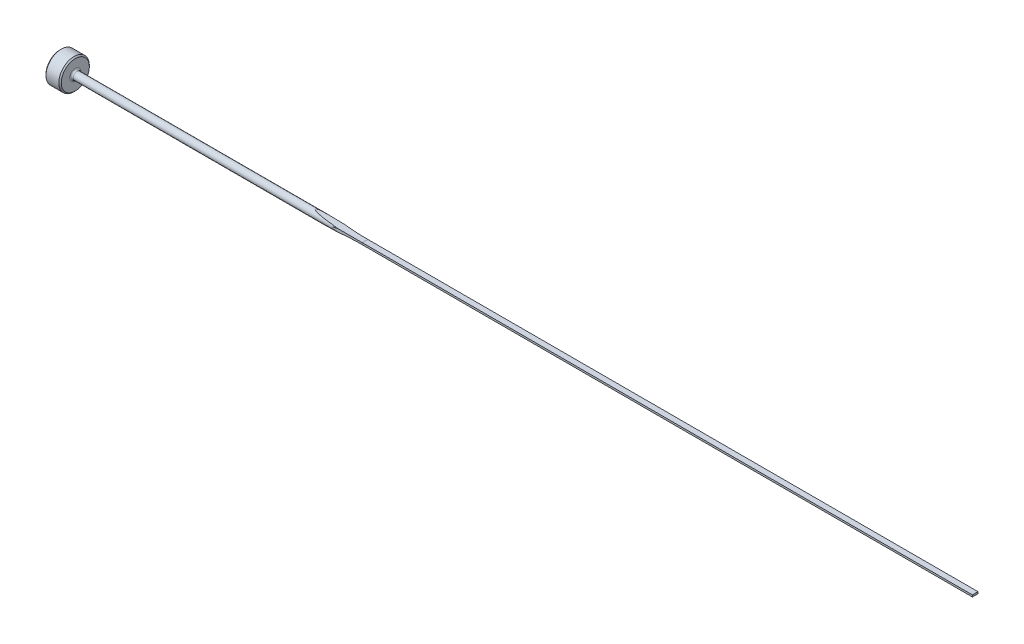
ISO-10303-21;
HEADER;
FILE_DESCRIPTION(('STEP AP214'),'2;1');
FILE_NAME('part.step','',(''),(''),'','','');
FILE_SCHEMA(('AUTOMOTIVE_DESIGN { 1 0 10303 214 1 1 1 1 }'));
ENDSEC;
DATA;
#1=APPLICATION_CONTEXT('core data for automotive mechanical design processes');
#2=APPLICATION_PROTOCOL_DEFINITION('international standard','automotive_design',2000,#1);
#3=PRODUCT_CONTEXT('',#1,'mechanical');
#4=PRODUCT('Part','Part','',(#3));
#5=PRODUCT_RELATED_PRODUCT_CATEGORY('part','',(#4));
#6=PRODUCT_DEFINITION_FORMATION('','',#4);
#7=PRODUCT_DEFINITION_CONTEXT('part definition',#1,'design');
#8=PRODUCT_DEFINITION('design','',#6,#7);
#9=PRODUCT_DEFINITION_SHAPE('','',#8);
#10=(LENGTH_UNIT() NAMED_UNIT(*) SI_UNIT(.MILLI.,.METRE.));
#11=(NAMED_UNIT(*) PLANE_ANGLE_UNIT() SI_UNIT($,.RADIAN.));
#12=(NAMED_UNIT(*) SI_UNIT($,.STERADIAN.) SOLID_ANGLE_UNIT());
#13=UNCERTAINTY_MEASURE_WITH_UNIT(LENGTH_MEASURE(1.E-05),#10,'distance_accuracy_value','');
#14=(GEOMETRIC_REPRESENTATION_CONTEXT(3) GLOBAL_UNCERTAINTY_ASSIGNED_CONTEXT((#13)) GLOBAL_UNIT_ASSIGNED_CONTEXT((#10,
#11,#12)) REPRESENTATION_CONTEXT('',''));
#15=CARTESIAN_POINT('',(0.,0.,0.));
#16=DIRECTION('',(0.,0.,1.));
#17=DIRECTION('',(1.,0.,0.));
#18=AXIS2_PLACEMENT_3D('',#15,#16,#17);
#19=CARTESIAN_POINT('',(0.,0.,0.));
#20=DIRECTION('',(-1.,0.,0.));
#21=DIRECTION('',(0.,0.,1.));
#22=AXIS2_PLACEMENT_3D('',#19,#20,#21);
#23=CYLINDRICAL_SURFACE('',#22,0.79375);
#24=CARTESIAN_POINT('',(3.556,0.,0.));
#25=DIRECTION('',(-1.,0.,0.));
#26=DIRECTION('',(0.,0.,1.));
#27=AXIS2_PLACEMENT_3D('',#24,#25,#26);
#28=CIRCLE('',#27,0.79375);
#29=CARTESIAN_POINT('',(3.556,0.,0.79375));
#30=VERTEX_POINT('',#29);
#31=EDGE_CURVE('E152',#30,#30,#28,.F.);
#32=ORIENTED_EDGE('',*,*,#31,.T.);
#33=EDGE_LOOP('',(#32));
#34=FACE_BOUND('',#33,.T.);
#35=CARTESIAN_POINT('',(63.5,0.537354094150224,0.584199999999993));
#36=CARTESIAN_POINT('',(63.3677986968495,0.537352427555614,0.584199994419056));
#37=CARTESIAN_POINT('',(63.2355977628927,0.537033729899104,0.584494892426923));
#38=CARTESIAN_POINT('',(62.9711986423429,0.535747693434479,0.585674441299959));
#39=CARTESIAN_POINT('',(62.8390004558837,0.534780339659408,0.586559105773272));
#40=CARTESIAN_POINT('',(62.4420069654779,0.53087936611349,0.590101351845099));
#41=CARTESIAN_POINT('',(62.1772280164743,0.526946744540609,0.593647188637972));
#42=CARTESIAN_POINT('',(61.6475584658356,0.516094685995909,0.603107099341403));
#43=CARTESIAN_POINT('',(61.3826679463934,0.509172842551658,0.609023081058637));
#44=CARTESIAN_POINT('',(60.8530338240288,0.491693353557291,0.623220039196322));
#45=CARTESIAN_POINT('',(60.58829024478,0.481135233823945,0.631501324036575));
#46=CARTESIAN_POINT('',(60.0594832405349,0.455276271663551,0.650407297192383));
#47=CARTESIAN_POINT('',(59.7954193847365,0.439982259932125,0.661028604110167));
#48=CARTESIAN_POINT('',(59.39981069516,0.411723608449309,0.678705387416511));
#49=CARTESIAN_POINT('',(59.2680369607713,0.401419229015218,0.684887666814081));
#50=CARTESIAN_POINT('',(59.004722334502,0.378486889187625,0.697828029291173));
#51=CARTESIAN_POINT('',(58.8731814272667,0.36585908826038,0.704586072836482));
#52=CARTESIAN_POINT('',(58.6761769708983,0.344482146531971,0.715145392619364));
#53=CARTESIAN_POINT('',(58.6105699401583,0.33695195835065,0.71873496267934));
#54=CARTESIAN_POINT('',(58.4794798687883,0.320881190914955,0.726052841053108));
#55=CARTESIAN_POINT('',(58.4139968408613,0.312340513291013,0.729781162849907));
#56=CARTESIAN_POINT('',(58.2830735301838,0.293954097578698,0.737380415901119));
#57=CARTESIAN_POINT('',(58.2176336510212,0.284105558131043,0.741251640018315));
#58=CARTESIAN_POINT('',(58.0870608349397,0.262655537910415,0.749120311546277));
#59=CARTESIAN_POINT('',(58.0219278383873,0.25105441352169,0.753117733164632));
#60=CARTESIAN_POINT('',(57.8919403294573,0.22526665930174,0.761238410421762));
#61=CARTESIAN_POINT('',(57.8270873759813,0.211071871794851,0.765362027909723));
#62=CARTESIAN_POINT('',(57.7307839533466,0.1864338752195,0.771589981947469));
#63=CARTESIAN_POINT('',(57.6989102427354,0.177685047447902,0.773668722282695));
#64=CARTESIAN_POINT('',(57.6356848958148,0.158500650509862,0.777825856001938));
#65=CARTESIAN_POINT('',(57.6043331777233,0.14806534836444,0.779904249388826));
#66=CARTESIAN_POINT('',(57.5449685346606,0.12536357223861,0.783870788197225));
#67=CARTESIAN_POINT('',(57.5168860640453,0.113303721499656,0.785761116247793));
#68=CARTESIAN_POINT('',(57.4787827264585,0.0926836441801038,0.788342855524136));
#69=CARTESIAN_POINT('',(57.4676987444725,0.0861257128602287,0.789096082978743));
#70=CARTESIAN_POINT('',(57.4464596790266,0.0716589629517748,0.790543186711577));
#71=CARTESIAN_POINT('',(57.4362989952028,0.0637592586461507,0.791237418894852));
#72=CARTESIAN_POINT('',(57.4241935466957,0.0517558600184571,0.792066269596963));
#73=CARTESIAN_POINT('',(57.4212914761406,0.0486376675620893,0.792265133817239));
#74=CARTESIAN_POINT('',(57.4158307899,0.0421001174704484,0.792639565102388));
#75=CARTESIAN_POINT('',(57.4132726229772,0.0386803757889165,0.792815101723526));
#76=CARTESIAN_POINT('',(57.4086203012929,0.0314630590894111,0.793134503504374));
#77=CARTESIAN_POINT('',(57.4065328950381,0.0276609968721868,0.793277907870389));
#78=CARTESIAN_POINT('',(57.4030925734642,0.0197374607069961,0.793514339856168));
#79=CARTESIAN_POINT('',(57.4017370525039,0.0156171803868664,0.793607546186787));
#80=CARTESIAN_POINT('',(57.4002141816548,0.00832744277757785,0.793712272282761));
#81=CARTESIAN_POINT('',(57.3998236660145,0.00520497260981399,0.793739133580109));
#82=CARTESIAN_POINT('',(57.3995863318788,-0.0010609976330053,0.793755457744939));
#83=CARTESIAN_POINT('',(57.3997393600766,-0.00420449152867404,0.793744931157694));
#84=CARTESIAN_POINT('',(57.4005699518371,-0.0104090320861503,0.793687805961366));
#85=CARTESIAN_POINT('',(57.4012458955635,-0.013470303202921,0.793641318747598));
#86=CARTESIAN_POINT('',(57.4030509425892,-0.0194544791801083,0.793517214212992));
#87=CARTESIAN_POINT('',(57.4041804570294,-0.0223772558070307,0.79343956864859));
#88=CARTESIAN_POINT('',(57.4075834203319,-0.0297362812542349,0.793205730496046));
#89=CARTESIAN_POINT('',(57.410137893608,-0.0340408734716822,0.793030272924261));
#90=CARTESIAN_POINT('',(57.4158647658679,-0.0422141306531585,0.792637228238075));
#91=CARTESIAN_POINT('',(57.4190391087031,-0.0460813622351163,0.792419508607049));
#92=CARTESIAN_POINT('',(57.4306425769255,-0.0587562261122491,0.791624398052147));
#93=CARTESIAN_POINT('',(57.4400482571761,-0.0666461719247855,0.790981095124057));
#94=CARTESIAN_POINT('',(57.4598384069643,-0.0810740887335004,0.78963111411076));
#95=CARTESIAN_POINT('',(57.470228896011,-0.0876028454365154,0.788924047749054));
#96=CARTESIAN_POINT('',(57.5002052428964,-0.104735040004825,0.786889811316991));
#97=CARTESIAN_POINT('',(57.5203710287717,-0.114312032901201,0.785527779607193));
#98=CARTESIAN_POINT('',(57.5614041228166,-0.131848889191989,0.782770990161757));
#99=CARTESIAN_POINT('',(57.5822732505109,-0.13980411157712,0.78137615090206));
#100=CARTESIAN_POINT('',(57.6454933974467,-0.162091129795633,0.777173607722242));
#101=CARTESIAN_POINT('',(57.688404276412,-0.17481938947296,0.774351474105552));
#102=CARTESIAN_POINT('',(57.8170052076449,-0.20942402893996,0.765989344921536));
#103=CARTESIAN_POINT('',(57.9035078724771,-0.228079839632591,0.760489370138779));
#104=CARTESIAN_POINT('',(58.0773949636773,-0.261317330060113,0.749691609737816));
#105=CARTESIAN_POINT('',(58.1647806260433,-0.275892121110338,0.744394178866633));
#106=CARTESIAN_POINT('',(58.3398406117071,-0.302364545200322,0.734042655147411));
#107=CARTESIAN_POINT('',(58.4275143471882,-0.314265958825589,0.728988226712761));
#108=CARTESIAN_POINT('',(58.6030327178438,-0.336200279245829,0.719131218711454));
#109=CARTESIAN_POINT('',(58.6908771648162,-0.346234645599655,0.714328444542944));
#110=CARTESIAN_POINT('',(58.9696341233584,-0.375842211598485,0.699503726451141));
#111=CARTESIAN_POINT('',(59.1608447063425,-0.392834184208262,0.689952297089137));
#112=CARTESIAN_POINT('',(59.5436524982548,-0.422669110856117,0.672072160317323));
#113=CARTESIAN_POINT('',(59.7352497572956,-0.435511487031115,0.663743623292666));
#114=CARTESIAN_POINT('',(60.118807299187,-0.458164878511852,0.648315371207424));
#115=CARTESIAN_POINT('',(60.3107677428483,-0.467973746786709,0.641216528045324));
#116=CARTESIAN_POINT('',(60.6948219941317,-0.485222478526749,0.628261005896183));
#117=CARTESIAN_POINT('',(60.8869157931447,-0.492662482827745,0.622404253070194));
#118=CARTESIAN_POINT('',(61.4633489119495,-0.512094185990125,0.60670099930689));
#119=CARTESIAN_POINT('',(61.847838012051,-0.521197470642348,0.59872158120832));
#120=CARTESIAN_POINT('',(62.6168658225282,-0.53352023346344,0.587755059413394));
#121=CARTESIAN_POINT('',(63.0014044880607,-0.536741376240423,0.584766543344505));
#122=CARTESIAN_POINT('',(63.4239617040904,-0.537327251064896,0.584224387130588));
#123=CARTESIAN_POINT('',(63.4619808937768,-0.537353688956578,0.584199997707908));
#124=CARTESIAN_POINT('',(63.5,-0.537354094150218,0.584199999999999));
#125=B_SPLINE_CURVE_WITH_KNOTS('',3,(#35,#36,#37,#38,#39,#40,#41,#42,#43,#44,#45,#46,#47,#48,
#49,#50,#51,#52,#53,#54,#55,#56,#57,#58,#59,#60,#61,#62,#63,#64,#65,#66,#67,#68,#69,#70,#71,#72,
#73,#74,#75,#76,#77,#78,#79,#80,#81,#82,#83,#84,#85,#86,#87,#88,#89,#90,#91,#92,#93,#94,#95,#96,
#97,#98,#99,#100,#101,#102,#103,#104,#105,#106,#107,#108,#109,#110,#111,#112,#113,#114,#115,
#116,#117,#118,#119,#120,#121,#122,#123,#124),.UNSPECIFIED.,.F.,.F.,(4,2,2,2,2,2,2,2,2,2,2,2,2,
2,2,2,2,2,2,2,2,2,2,2,2,2,2,2,2,2,2,2,2,2,2,2,2,2,2,2,2,2,2,2,4),(0.,0.396602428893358,
0.793214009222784,1.58768292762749,2.38279262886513,3.1780060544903,3.97207782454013,
4.36902531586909,4.76594557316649,4.96434526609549,5.16276428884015,5.36161538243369,
5.56042609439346,5.7598732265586,5.85918782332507,5.95848671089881,6.05003157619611,
6.08869793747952,6.12711144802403,6.13988635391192,6.15267777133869,6.16564230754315,
6.17856037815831,6.18795697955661,6.19735093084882,6.20671589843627,6.21608937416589,
6.23102781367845,6.24601387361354,6.28261070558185,6.3194477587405,6.38636719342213,
6.45347552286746,6.58786698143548,6.85363398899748,7.11984693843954,7.38568101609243,
7.65130639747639,8.22782048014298,8.80441481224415,9.38141631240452,9.95838350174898,
11.1123237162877,12.2659373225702,12.37999486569),.UNSPECIFIED.);
#126=CARTESIAN_POINT('',(58.5437773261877,0.328763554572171,0.722463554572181));
#127=VERTEX_POINT('',#126);
#128=CARTESIAN_POINT('',(58.5437773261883,-0.328763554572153,0.722463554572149));
#129=VERTEX_POINT('',#128);
#130=EDGE_CURVE('E155',#127,#129,#125,.T.);
#131=ORIENTED_EDGE('',*,*,#130,.F.);
#132=CARTESIAN_POINT('',(63.5,0.190499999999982,0.770550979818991));
#133=CARTESIAN_POINT('',(63.2354977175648,0.190500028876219,0.770543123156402));
#134=CARTESIAN_POINT('',(62.9709978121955,0.191680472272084,0.770261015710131));
#135=CARTESIAN_POINT('',(62.4418252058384,0.196403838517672,0.769072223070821));
#136=CARTESIAN_POINT('',(62.1771525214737,0.199948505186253,0.768165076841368));
#137=CARTESIAN_POINT('',(61.3824806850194,0.21414145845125,0.764388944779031));
#138=CARTESIAN_POINT('',(60.8525422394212,0.228348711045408,0.760464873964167));
#139=CARTESIAN_POINT('',(60.0578861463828,0.256766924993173,0.751134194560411));
#140=CARTESIAN_POINT('',(59.7930152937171,0.267425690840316,0.747449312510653));
#141=CARTESIAN_POINT('',(59.2634058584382,0.291110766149,0.738549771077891));
#142=CARTESIAN_POINT('',(58.9986672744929,0.304137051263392,0.733335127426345));
#143=CARTESIAN_POINT('',(58.4695875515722,0.33254218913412,0.720898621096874));
#144=CARTESIAN_POINT('',(58.2052462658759,0.34791904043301,0.713678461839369));
#145=CARTESIAN_POINT('',(57.676798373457,0.381028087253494,0.696567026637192));
#146=CARTESIAN_POINT('',(57.4126917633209,0.398760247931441,0.686675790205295));
#147=CARTESIAN_POINT('',(56.8849021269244,0.436563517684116,0.663283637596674));
#148=CARTESIAN_POINT('',(56.6212189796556,0.456633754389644,0.649784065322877));
#149=CARTESIAN_POINT('',(56.0943507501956,0.499099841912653,0.617784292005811));
#150=CARTESIAN_POINT('',(55.831165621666,0.521495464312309,0.599284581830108));
#151=CARTESIAN_POINT('',(55.4370166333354,0.556801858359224,0.565921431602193));
#152=CARTESIAN_POINT('',(55.3057389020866,0.568856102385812,0.553864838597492));
#153=CARTESIAN_POINT('',(55.0434383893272,0.593528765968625,0.527346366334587));
#154=CARTESIAN_POINT('',(54.9124156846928,0.606147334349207,0.512883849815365));
#155=CARTESIAN_POINT('',(54.6506137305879,0.631946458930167,0.48073579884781));
#156=CARTESIAN_POINT('',(54.5198351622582,0.645127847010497,0.463045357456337));
#157=CARTESIAN_POINT('',(54.2590586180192,0.671994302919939,0.423151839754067));
#158=CARTESIAN_POINT('',(54.1290602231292,0.685679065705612,0.400951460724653));
#159=CARTESIAN_POINT('',(53.9485864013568,0.705076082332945,0.364742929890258));
#160=CARTESIAN_POINT('',(53.8974648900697,0.710615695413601,0.353876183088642));
#161=CARTESIAN_POINT('',(53.7955354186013,0.721749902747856,0.330583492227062));
#162=CARTESIAN_POINT('',(53.7447277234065,0.727344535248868,0.318156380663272));
#163=CARTESIAN_POINT('',(53.643779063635,0.738547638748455,0.291200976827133));
#164=CARTESIAN_POINT('',(53.5936370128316,0.744156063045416,0.276676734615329));
#165=CARTESIAN_POINT('',(53.4943683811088,0.755343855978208,0.244529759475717));
#166=CARTESIAN_POINT('',(53.4452403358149,0.760923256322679,0.226911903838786));
#167=CARTESIAN_POINT('',(53.3731852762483,0.769164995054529,0.196296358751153));
#168=CARTESIAN_POINT('',(53.3493942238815,0.771896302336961,0.185367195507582));
#169=CARTESIAN_POINT('',(53.3028927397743,0.777253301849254,0.161463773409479));
#170=CARTESIAN_POINT('',(53.2801786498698,0.779879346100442,0.148497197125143));
#171=CARTESIAN_POINT('',(53.2500391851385,0.783374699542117,0.128048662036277));
#172=CARTESIAN_POINT('',(53.2416704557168,0.784346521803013,0.121988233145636));
#173=CARTESIAN_POINT('',(53.225433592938,0.786234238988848,0.109166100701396));
#174=CARTESIAN_POINT('',(53.2175668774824,0.78714997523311,0.102402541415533));
#175=CARTESIAN_POINT('',(53.2025456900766,0.788900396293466,0.0879169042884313));
#176=CARTESIAN_POINT('',(53.1954016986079,0.789733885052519,0.0801836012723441));
#177=CARTESIAN_POINT('',(53.1825061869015,0.791239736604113,0.0636171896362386));
#178=CARTESIAN_POINT('',(53.1767475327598,0.791912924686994,0.0547900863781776));
#179=CARTESIAN_POINT('',(53.1696621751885,0.792741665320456,0.0403159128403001));
#180=CARTESIAN_POINT('',(53.1675163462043,0.792992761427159,0.0350797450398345));
#181=CARTESIAN_POINT('',(53.1640779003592,0.793395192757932,0.0243299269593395));
#182=CARTESIAN_POINT('',(53.1627841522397,0.7935466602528,0.0188166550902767));
#183=CARTESIAN_POINT('',(53.1611884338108,0.793733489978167,0.00760256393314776));
#184=CARTESIAN_POINT('',(53.1608934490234,0.793768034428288,0.00190070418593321));
#185=CARTESIAN_POINT('',(53.1613552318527,0.793713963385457,-0.0094609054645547));
#186=CARTESIAN_POINT('',(53.1621124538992,0.793625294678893,-0.0151206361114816));
#187=CARTESIAN_POINT('',(53.1644878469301,0.793347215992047,-0.025801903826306));
#188=CARTESIAN_POINT('',(53.1660373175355,0.793165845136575,-0.0308394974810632));
#189=CARTESIAN_POINT('',(53.1698145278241,0.792723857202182,-0.0406454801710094));
#190=CARTESIAN_POINT('',(53.1720424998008,0.792463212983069,-0.0454137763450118));
#191=CARTESIAN_POINT('',(53.1790063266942,0.791648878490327,-0.0583107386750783));
#192=CARTESIAN_POINT('',(53.1843320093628,0.791026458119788,-0.0661144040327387));
#193=CARTESIAN_POINT('',(53.1960671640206,0.789656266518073,-0.0808494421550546));
#194=CARTESIAN_POINT('',(53.2024807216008,0.788908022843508,-0.087777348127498));
#195=CARTESIAN_POINT('',(53.2270824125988,0.786040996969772,-0.111767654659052));
#196=CARTESIAN_POINT('',(53.2472565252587,0.783695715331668,-0.126716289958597));
#197=CARTESIAN_POINT('',(53.2893601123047,0.778817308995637,-0.153835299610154));
#198=CARTESIAN_POINT('',(53.3113004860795,0.776283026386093,-0.165986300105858));
#199=CARTESIAN_POINT('',(53.3770598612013,0.768713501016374,-0.199075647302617));
#200=CARTESIAN_POINT('',(53.4220934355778,0.763562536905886,-0.217563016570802));
#201=CARTESIAN_POINT('',(53.5134440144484,0.753187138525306,-0.251080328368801));
#202=CARTESIAN_POINT('',(53.5597643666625,0.747962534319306,-0.266100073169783));
#203=CARTESIAN_POINT('',(53.6531707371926,0.737502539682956,-0.293855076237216));
#204=CARTESIAN_POINT('',(53.7002578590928,0.732267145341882,-0.306586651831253));
#205=CARTESIAN_POINT('',(53.7947678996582,0.721836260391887,-0.330390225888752));
#206=CARTESIAN_POINT('',(53.8421902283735,0.716640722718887,-0.341464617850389));
#207=CARTESIAN_POINT('',(53.9839153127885,0.701229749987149,-0.372633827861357));
#208=CARTESIAN_POINT('',(54.0786194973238,0.691084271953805,-0.390933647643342));
#209=CARTESIAN_POINT('',(54.2686125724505,0.671041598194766,-0.424400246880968));
#210=CARTESIAN_POINT('',(54.3639016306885,0.66114447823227,-0.439566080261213));
#211=CARTESIAN_POINT('',(54.5549690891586,0.641612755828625,-0.46761628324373));
#212=CARTESIAN_POINT('',(54.6507479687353,0.631978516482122,-0.480497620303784));
#213=CARTESIAN_POINT('',(54.842558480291,0.613000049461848,-0.504481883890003));
#214=CARTESIAN_POINT('',(54.9385901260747,0.60365583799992,-0.515584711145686));
#215=CARTESIAN_POINT('',(55.2266907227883,0.576097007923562,-0.546742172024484));
#216=CARTESIAN_POINT('',(55.4190308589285,0.558329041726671,-0.564682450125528));
#217=CARTESIAN_POINT('',(55.8039936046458,0.524034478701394,-0.596629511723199));
#218=CARTESIAN_POINT('',(55.9966159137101,0.507507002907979,-0.610639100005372));
#219=CARTESIAN_POINT('',(56.4885389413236,0.466916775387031,-0.642671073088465));
#220=CARTESIAN_POINT('',(56.7880448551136,0.443729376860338,-0.65864098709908));
#221=CARTESIAN_POINT('',(57.3874973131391,0.400378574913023,-0.685843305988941));
#222=CARTESIAN_POINT('',(57.6874438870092,0.380215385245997,-0.697075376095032));
#223=CARTESIAN_POINT('',(58.287769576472,0.342918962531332,-0.716159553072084));
#224=CARTESIAN_POINT('',(58.588148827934,0.325787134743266,-0.724010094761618));
#225=CARTESIAN_POINT('',(59.1891202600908,0.294571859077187,-0.737260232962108));
#226=CARTESIAN_POINT('',(59.4897124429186,0.280488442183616,-0.7426598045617));
#227=CARTESIAN_POINT('',(60.0909877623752,0.255376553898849,-0.751664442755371));
#228=CARTESIAN_POINT('',(60.3916708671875,0.24434744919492,-0.755269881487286));
#229=CARTESIAN_POINT('',(60.9931486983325,0.225342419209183,-0.761156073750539));
#230=CARTESIAN_POINT('',(61.2939434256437,0.217366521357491,-0.763436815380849));
#231=CARTESIAN_POINT('',(61.8955461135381,0.204470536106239,-0.766991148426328));
#232=CARTESIAN_POINT('',(62.1963540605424,0.199549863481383,-0.76826493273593));
#233=CARTESIAN_POINT('',(62.7980062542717,0.192762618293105,-0.76999615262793));
#234=CARTESIAN_POINT('',(63.0988505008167,0.190896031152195,-0.770453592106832));
#235=CARTESIAN_POINT('',(63.4331297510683,0.190518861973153,-0.770546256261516));
#236=CARTESIAN_POINT('',(63.4665648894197,0.190499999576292,-0.77055090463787));
#237=CARTESIAN_POINT('',(63.5,0.190499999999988,-0.770550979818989));
#238=B_SPLINE_CURVE_WITH_KNOTS('',3,(#132,#133,#134,#135,#136,#137,#138,#139,#140,#141,#142,
#143,#144,#145,#146,#147,#148,#149,#150,#151,#152,#153,#154,#155,#156,#157,#158,#159,#160,#161,
#162,#163,#164,#165,#166,#167,#168,#169,#170,#171,#172,#173,#174,#175,#176,#177,#178,#179,#180,
#181,#182,#183,#184,#185,#186,#187,#188,#189,#190,#191,#192,#193,#194,#195,#196,#197,#198,#199,
#200,#201,#202,#203,#204,#205,#206,#207,#208,#209,#210,#211,#212,#213,#214,#215,#216,#217,#218,
#219,#220,#221,#222,#223,#224,#225,#226,#227,#228,#229,#230,#231,#232,#233,#234,#235,#236,#237),
.UNSPECIFIED.,.F.,.F.,(4,2,2,2,2,2,2,2,2,2,2,2,2,2,2,2,2,2,2,2,2,2,2,2,2,2,2,2,2,2,2,2,2,2,2,2,
2,2,2,2,2,2,2,2,2,2,2,2,2,2,2,2,4),(0.,0.793499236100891,1.58758439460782,3.17789787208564,
3.97321935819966,4.76853266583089,5.5631725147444,6.35780060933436,7.15213316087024,
7.94638776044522,8.34351214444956,8.74074188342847,9.13858058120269,9.53618203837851,
9.6938360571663,9.85160874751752,10.0090807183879,10.166306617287,10.2452331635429,
10.3238689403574,10.3549791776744,10.3861737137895,10.4177700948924,10.4492001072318,
10.4661348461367,10.4830470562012,10.5000773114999,10.517114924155,10.5328769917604,
10.5486444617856,10.5768825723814,10.6052291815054,10.6802907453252,10.7558574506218,
10.9023193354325,11.0492066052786,11.1963282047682,11.3432352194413,11.6341014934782,
11.9250554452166,12.2163927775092,12.5077463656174,13.0896456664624,13.6711286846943,
14.5735272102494,15.475989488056,16.3788690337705,17.2817577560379,18.1844591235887,
19.0871686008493,19.9897051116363,20.8922373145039,20.9925427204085),.UNSPECIFIED.);
#239=CARTESIAN_POINT('',(58.5437773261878,0.328763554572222,-0.722463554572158));
#240=VERTEX_POINT('',#239);
#241=EDGE_CURVE('E105',#127,#240,#238,.T.);
#242=ORIENTED_EDGE('',*,*,#241,.T.);
#243=CARTESIAN_POINT('',(63.5,0.537354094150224,-0.584199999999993));
#244=CARTESIAN_POINT('',(63.3677986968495,0.537352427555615,-0.584199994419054));
#245=CARTESIAN_POINT('',(63.2355977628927,0.537033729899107,-0.584494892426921));
#246=CARTESIAN_POINT('',(62.9711986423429,0.535747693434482,-0.585674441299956));
#247=CARTESIAN_POINT('',(62.8390004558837,0.534780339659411,-0.586559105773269));
#248=CARTESIAN_POINT('',(62.4420069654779,0.530879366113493,-0.590101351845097));
#249=CARTESIAN_POINT('',(62.1772280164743,0.526946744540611,-0.593647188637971));
#250=CARTESIAN_POINT('',(61.6475584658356,0.516094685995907,-0.603107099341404));
#251=CARTESIAN_POINT('',(61.3826679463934,0.509172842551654,-0.60902308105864));
#252=CARTESIAN_POINT('',(60.8530338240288,0.491693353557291,-0.623220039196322));
#253=CARTESIAN_POINT('',(60.58829024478,0.481135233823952,-0.63150132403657));
#254=CARTESIAN_POINT('',(60.0594832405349,0.455276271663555,-0.65040729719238));
#255=CARTESIAN_POINT('',(59.7954193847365,0.439982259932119,-0.66102860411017));
#256=CARTESIAN_POINT('',(59.39981069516,0.411723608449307,-0.678705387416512));
#257=CARTESIAN_POINT('',(59.2680369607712,0.401419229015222,-0.684887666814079));
#258=CARTESIAN_POINT('',(59.0047223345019,0.378486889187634,-0.697828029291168));
#259=CARTESIAN_POINT('',(58.8731814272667,0.36585908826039,-0.704586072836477));
#260=CARTESIAN_POINT('',(58.6761769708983,0.344482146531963,-0.715145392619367));
#261=CARTESIAN_POINT('',(58.6105699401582,0.336951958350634,-0.718734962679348));
#262=CARTESIAN_POINT('',(58.4794798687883,0.320881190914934,-0.726052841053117));
#263=CARTESIAN_POINT('',(58.4139968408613,0.312340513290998,-0.729781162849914));
#264=CARTESIAN_POINT('',(58.2830735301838,0.293954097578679,-0.737380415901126));
#265=CARTESIAN_POINT('',(58.2176336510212,0.284105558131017,-0.741251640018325));
#266=CARTESIAN_POINT('',(58.0870608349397,0.262655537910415,-0.749120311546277));
#267=CARTESIAN_POINT('',(58.0219278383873,0.251054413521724,-0.753117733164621));
#268=CARTESIAN_POINT('',(57.8919403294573,0.225266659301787,-0.761238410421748));
#269=CARTESIAN_POINT('',(57.8270873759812,0.211071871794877,-0.765362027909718));
#270=CARTESIAN_POINT('',(57.7307839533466,0.18643387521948,-0.771589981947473));
#271=CARTESIAN_POINT('',(57.6989102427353,0.177685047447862,-0.773668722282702));
#272=CARTESIAN_POINT('',(57.6356848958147,0.158500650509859,-0.77782585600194));
#273=CARTESIAN_POINT('',(57.6043331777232,0.148065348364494,-0.779904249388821));
#274=CARTESIAN_POINT('',(57.5449685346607,0.125363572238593,-0.783870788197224));
#275=CARTESIAN_POINT('',(57.5168860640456,0.113303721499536,-0.785761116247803));
#276=CARTESIAN_POINT('',(57.4787827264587,0.0926836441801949,-0.788342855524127));
#277=CARTESIAN_POINT('',(57.4676987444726,0.0861257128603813,-0.789096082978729));
#278=CARTESIAN_POINT('',(57.4464596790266,0.0716589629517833,-0.790543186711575));
#279=CARTESIAN_POINT('',(57.4362989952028,0.0637592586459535,-0.791237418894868));
#280=CARTESIAN_POINT('',(57.4241935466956,0.0517558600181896,-0.792066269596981));
#281=CARTESIAN_POINT('',(57.4212914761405,0.0486376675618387,-0.792265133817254));
#282=CARTESIAN_POINT('',(57.4158307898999,0.0421001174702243,-0.7926395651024));
#283=CARTESIAN_POINT('',(57.4132726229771,0.0386803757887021,-0.792815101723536));
#284=CARTESIAN_POINT('',(57.4086203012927,0.0314630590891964,-0.793134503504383));
#285=CARTESIAN_POINT('',(57.406532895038,0.0276609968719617,-0.793277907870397));
#286=CARTESIAN_POINT('',(57.4030925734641,0.0197374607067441,-0.793514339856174));
#287=CARTESIAN_POINT('',(57.4017370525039,0.0156171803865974,-0.793607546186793));
#288=CARTESIAN_POINT('',(57.4002141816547,0.00832744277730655,-0.793712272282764));
#289=CARTESIAN_POINT('',(57.3998236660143,0.00520497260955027,-0.793739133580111));
#290=CARTESIAN_POINT('',(57.3995863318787,-0.00106099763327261,-0.793755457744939));
#291=CARTESIAN_POINT('',(57.3997393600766,-0.00420449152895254,-0.793744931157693));
#292=CARTESIAN_POINT('',(57.4005699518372,-0.0104090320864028,-0.793687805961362));
#293=CARTESIAN_POINT('',(57.4012458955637,-0.0134703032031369,-0.793641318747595));
#294=CARTESIAN_POINT('',(57.4030509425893,-0.0194544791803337,-0.793517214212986));
#295=CARTESIAN_POINT('',(57.4041804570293,-0.0223772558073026,-0.793439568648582));
#296=CARTESIAN_POINT('',(57.4075834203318,-0.0297362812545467,-0.793205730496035));
#297=CARTESIAN_POINT('',(57.4101378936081,-0.0340408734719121,-0.793030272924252));
#298=CARTESIAN_POINT('',(57.4158647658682,-0.0422141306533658,-0.792637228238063));
#299=CARTESIAN_POINT('',(57.4190391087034,-0.0460813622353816,-0.792419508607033));
#300=CARTESIAN_POINT('',(57.4306425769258,-0.0587562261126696,-0.791624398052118));
#301=CARTESIAN_POINT('',(57.4400482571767,-0.0666461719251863,-0.790981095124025));
#302=CARTESIAN_POINT('',(57.4598384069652,-0.0810740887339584,-0.789631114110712));
#303=CARTESIAN_POINT('',(57.4702288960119,-0.0876028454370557,-0.788924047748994));
#304=CARTESIAN_POINT('',(57.5002052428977,-0.104735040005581,-0.786889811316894));
#305=CARTESIAN_POINT('',(57.5203710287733,-0.114312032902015,-0.785527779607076));
#306=CARTESIAN_POINT('',(57.5614041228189,-0.131848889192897,-0.782770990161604));
#307=CARTESIAN_POINT('',(57.5822732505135,-0.139804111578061,-0.781376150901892));
#308=CARTESIAN_POINT('',(57.6454933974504,-0.162091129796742,-0.777173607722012));
#309=CARTESIAN_POINT('',(57.6884042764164,-0.174819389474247,-0.774351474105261));
#310=CARTESIAN_POINT('',(57.8170052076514,-0.209424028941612,-0.765989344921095));
#311=CARTESIAN_POINT('',(57.903507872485,-0.228079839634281,-0.760489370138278));
#312=CARTESIAN_POINT('',(58.077394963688,-0.261317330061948,-0.749691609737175));
#313=CARTESIAN_POINT('',(58.1647806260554,-0.275892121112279,-0.744394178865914));
#314=CARTESIAN_POINT('',(58.3398406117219,-0.302364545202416,-0.734042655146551));
#315=CARTESIAN_POINT('',(58.4275143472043,-0.314265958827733,-0.728988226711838));
#316=CARTESIAN_POINT('',(58.6030327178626,-0.336200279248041,-0.719131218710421));
#317=CARTESIAN_POINT('',(58.6908771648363,-0.346234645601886,-0.714328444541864));
#318=CARTESIAN_POINT('',(58.969634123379,-0.375842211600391,-0.699503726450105));
#319=CARTESIAN_POINT('',(59.1608447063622,-0.392834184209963,-0.689952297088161));
#320=CARTESIAN_POINT('',(59.5436524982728,-0.422669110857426,-0.672072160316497));
#321=CARTESIAN_POINT('',(59.7352497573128,-0.435511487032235,-0.663743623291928));
#322=CARTESIAN_POINT('',(60.1188072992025,-0.458164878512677,-0.648315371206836));
#323=CARTESIAN_POINT('',(60.310767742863,-0.467973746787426,-0.641216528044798));
#324=CARTESIAN_POINT('',(60.6948219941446,-0.485222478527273,-0.628261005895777));
#325=CARTESIAN_POINT('',(60.8869157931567,-0.492662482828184,-0.622404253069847));
#326=CARTESIAN_POINT('',(61.463348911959,-0.512094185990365,-0.606700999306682));
#327=CARTESIAN_POINT('',(61.8478380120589,-0.521197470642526,-0.598721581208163));
#328=CARTESIAN_POINT('',(62.6168658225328,-0.533520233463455,-0.58775505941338));
#329=CARTESIAN_POINT('',(63.0014044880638,-0.536741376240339,-0.584766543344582));
#330=CARTESIAN_POINT('',(63.4239617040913,-0.53732725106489,-0.584224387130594));
#331=CARTESIAN_POINT('',(63.4619808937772,-0.53735368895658,-0.584199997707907));
#332=CARTESIAN_POINT('',(63.5,-0.537354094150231,-0.584199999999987));
#333=B_SPLINE_CURVE_WITH_KNOTS('',3,(#243,#244,#245,#246,#247,#248,#249,#250,#251,#252,#253,
#254,#255,#256,#257,#258,#259,#260,#261,#262,#263,#264,#265,#266,#267,#268,#269,#270,#271,#272,
#273,#274,#275,#276,#277,#278,#279,#280,#281,#282,#283,#284,#285,#286,#287,#288,#289,#290,#291,
#292,#293,#294,#295,#296,#297,#298,#299,#300,#301,#302,#303,#304,#305,#306,#307,#308,#309,#310,
#311,#312,#313,#314,#315,#316,#317,#318,#319,#320,#321,#322,#323,#324,#325,#326,#327,#328,#329,
#330,#331,#332),.UNSPECIFIED.,.F.,.F.,(4,2,2,2,2,2,2,2,2,2,2,2,2,2,2,2,2,2,2,2,2,2,2,2,2,2,2,2,
2,2,2,2,2,2,2,2,2,2,2,2,2,2,2,2,4),(0.,0.396602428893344,0.793214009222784,1.58768292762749,
2.38279262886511,3.17800605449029,3.97207782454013,4.36902531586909,4.76594557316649,
4.96434526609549,5.16276428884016,5.3616153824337,5.56042609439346,5.75987322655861,
5.8591878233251,5.95848671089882,6.05003157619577,6.08869793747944,6.12711144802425,
6.13988635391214,6.15267777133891,6.16564230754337,6.17856037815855,6.18795697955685,
6.19735093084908,6.20671589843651,6.21608937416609,6.23102781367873,6.24601387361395,
6.2826107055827,6.31944775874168,6.38636719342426,6.45347552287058,6.58786698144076,
6.85363398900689,7.11984693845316,7.38568101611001,7.65130639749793,8.22782048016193,
8.8044148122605,9.38141631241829,9.95838350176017,11.1123237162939,12.2659373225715,
12.37999486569),.UNSPECIFIED.);
#334=CARTESIAN_POINT('',(58.5437773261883,-0.328763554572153,-0.722463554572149));
#335=VERTEX_POINT('',#334);
#336=EDGE_CURVE('E174',#240,#335,#333,.T.);
#337=ORIENTED_EDGE('',*,*,#336,.T.);
#338=CARTESIAN_POINT('',(63.5,-0.190499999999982,0.770550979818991));
#339=CARTESIAN_POINT('',(63.2354977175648,-0.190500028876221,0.770543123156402));
#340=CARTESIAN_POINT('',(62.9709978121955,-0.191680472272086,0.770261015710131));
#341=CARTESIAN_POINT('',(62.4418252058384,-0.196403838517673,0.769072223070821));
#342=CARTESIAN_POINT('',(62.1771525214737,-0.199948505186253,0.768165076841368));
#343=CARTESIAN_POINT('',(61.3824806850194,-0.214141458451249,0.764388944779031));
#344=CARTESIAN_POINT('',(60.8525422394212,-0.228348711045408,0.760464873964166));
#345=CARTESIAN_POINT('',(60.0578861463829,-0.256766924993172,0.751134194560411));
#346=CARTESIAN_POINT('',(59.7930152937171,-0.267425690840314,0.747449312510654));
#347=CARTESIAN_POINT('',(59.2634058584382,-0.291110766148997,0.738549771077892));
#348=CARTESIAN_POINT('',(58.9986672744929,-0.304137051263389,0.733335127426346));
#349=CARTESIAN_POINT('',(58.4695875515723,-0.332542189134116,0.720898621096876));
#350=CARTESIAN_POINT('',(58.2052462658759,-0.347919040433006,0.71367846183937));
#351=CARTESIAN_POINT('',(57.676798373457,-0.381028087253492,0.696567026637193));
#352=CARTESIAN_POINT('',(57.4126917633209,-0.398760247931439,0.686675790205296));
#353=CARTESIAN_POINT('',(56.8849021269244,-0.436563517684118,0.663283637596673));
#354=CARTESIAN_POINT('',(56.6212189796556,-0.456633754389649,0.649784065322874));
#355=CARTESIAN_POINT('',(56.0943507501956,-0.499099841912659,0.617784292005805));
#356=CARTESIAN_POINT('',(55.831165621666,-0.521495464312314,0.599284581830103));
#357=CARTESIAN_POINT('',(55.4370166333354,-0.55680185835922,0.565921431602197));
#358=CARTESIAN_POINT('',(55.3057389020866,-0.568856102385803,0.553864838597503));
#359=CARTESIAN_POINT('',(55.0434383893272,-0.593528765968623,0.527346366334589));
#360=CARTESIAN_POINT('',(54.9124156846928,-0.606147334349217,0.512883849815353));
#361=CARTESIAN_POINT('',(54.6506137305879,-0.631946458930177,0.480735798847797));
#362=CARTESIAN_POINT('',(54.5198351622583,-0.645127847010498,0.463045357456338));
#363=CARTESIAN_POINT('',(54.2590586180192,-0.671994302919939,0.423151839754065));
#364=CARTESIAN_POINT('',(54.1290602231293,-0.68567906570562,0.400951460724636));
#365=CARTESIAN_POINT('',(53.9485864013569,-0.705076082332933,0.364742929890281));
#366=CARTESIAN_POINT('',(53.8974648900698,-0.710615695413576,0.353876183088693));
#367=CARTESIAN_POINT('',(53.7955354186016,-0.721749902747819,0.33058349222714));
#368=CARTESIAN_POINT('',(53.7447277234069,-0.727344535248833,0.318156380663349));
#369=CARTESIAN_POINT('',(53.6437790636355,-0.738547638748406,0.291200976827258));
#370=CARTESIAN_POINT('',(53.5936370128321,-0.744156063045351,0.276676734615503));
#371=CARTESIAN_POINT('',(53.4943683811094,-0.75534385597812,0.244529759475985));
#372=CARTESIAN_POINT('',(53.4452403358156,-0.760923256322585,0.226911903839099));
#373=CARTESIAN_POINT('',(53.373185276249,-0.76916499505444,0.196296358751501));
#374=CARTESIAN_POINT('',(53.3493942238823,-0.771896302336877,0.185367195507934));
#375=CARTESIAN_POINT('',(53.3028927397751,-0.777253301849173,0.161463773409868));
#376=CARTESIAN_POINT('',(53.2801786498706,-0.779879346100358,0.148497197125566));
#377=CARTESIAN_POINT('',(53.2500391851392,-0.783374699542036,0.128048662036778));
#378=CARTESIAN_POINT('',(53.2416704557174,-0.784346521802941,0.121988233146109));
#379=CARTESIAN_POINT('',(53.2254335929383,-0.786234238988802,0.109166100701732));
#380=CARTESIAN_POINT('',(53.2175668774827,-0.787149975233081,0.10240254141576));
#381=CARTESIAN_POINT('',(53.2025456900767,-0.788900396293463,0.0879169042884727));
#382=CARTESIAN_POINT('',(53.1954016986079,-0.789733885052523,0.0801836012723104));
#383=CARTESIAN_POINT('',(53.1825061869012,-0.79123973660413,0.0636171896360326));
#384=CARTESIAN_POINT('',(53.1767475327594,-0.791912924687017,0.0547900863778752));
#385=CARTESIAN_POINT('',(53.1696621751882,-0.79274166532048,0.0403159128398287));
#386=CARTESIAN_POINT('',(53.1675163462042,-0.792992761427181,0.0350797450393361));
#387=CARTESIAN_POINT('',(53.164077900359,-0.793395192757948,0.0243299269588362));
#388=CARTESIAN_POINT('',(53.1627841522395,-0.793546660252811,0.0188166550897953));
#389=CARTESIAN_POINT('',(53.1611884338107,-0.793733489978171,0.00760256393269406));
#390=CARTESIAN_POINT('',(53.1608934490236,-0.79376803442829,0.00190070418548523));
#391=CARTESIAN_POINT('',(53.1613552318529,-0.793713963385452,-0.00946090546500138));
#392=CARTESIAN_POINT('',(53.1621124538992,-0.793625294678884,-0.0151206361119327));
#393=CARTESIAN_POINT('',(53.1644878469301,-0.793347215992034,-0.0258019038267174));
#394=CARTESIAN_POINT('',(53.1660373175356,-0.793165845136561,-0.0308394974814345));
#395=CARTESIAN_POINT('',(53.1698145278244,-0.792723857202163,-0.040645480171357));
#396=CARTESIAN_POINT('',(53.1720424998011,-0.792463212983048,-0.0454137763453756));
#397=CARTESIAN_POINT('',(53.1790063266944,-0.791648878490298,-0.0583107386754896));
#398=CARTESIAN_POINT('',(53.1843320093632,-0.791026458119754,-0.0661144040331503));
#399=CARTESIAN_POINT('',(53.1960671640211,-0.789656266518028,-0.080849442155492));
#400=CARTESIAN_POINT('',(53.2024807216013,-0.788908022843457,-0.0877773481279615));
#401=CARTESIAN_POINT('',(53.2270824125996,-0.786040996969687,-0.111767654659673));
#402=CARTESIAN_POINT('',(53.2472565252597,-0.783695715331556,-0.126716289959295));
#403=CARTESIAN_POINT('',(53.2893601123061,-0.778817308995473,-0.15383529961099));
#404=CARTESIAN_POINT('',(53.3113004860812,-0.776283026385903,-0.165986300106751));
#405=CARTESIAN_POINT('',(53.3770598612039,-0.768713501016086,-0.199075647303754));
#406=CARTESIAN_POINT('',(53.422093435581,-0.763562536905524,-0.217563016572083));
#407=CARTESIAN_POINT('',(53.513444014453,-0.753187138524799,-0.251080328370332));
#408=CARTESIAN_POINT('',(53.5597643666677,-0.747962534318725,-0.266100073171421));
#409=CARTESIAN_POINT('',(53.6531707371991,-0.737502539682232,-0.293855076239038));
#410=CARTESIAN_POINT('',(53.7002578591,-0.732267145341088,-0.306586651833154));
#411=CARTESIAN_POINT('',(53.7947678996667,-0.721836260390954,-0.330390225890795));
#412=CARTESIAN_POINT('',(53.8421902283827,-0.716640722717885,-0.341464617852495));
#413=CARTESIAN_POINT('',(53.9839153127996,-0.701229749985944,-0.372633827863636));
#414=CARTESIAN_POINT('',(54.0786194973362,-0.691084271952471,-0.390933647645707));
#415=CARTESIAN_POINT('',(54.2686125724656,-0.671041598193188,-0.424400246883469));
#416=CARTESIAN_POINT('',(54.3639016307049,-0.661144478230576,-0.439566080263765));
#417=CARTESIAN_POINT('',(54.5549690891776,-0.641612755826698,-0.467616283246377));
#418=CARTESIAN_POINT('',(54.6507479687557,-0.631978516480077,-0.480497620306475));
#419=CARTESIAN_POINT('',(54.842558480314,-0.613000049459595,-0.504481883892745));
#420=CARTESIAN_POINT('',(54.938590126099,-0.603655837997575,-0.515584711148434));
#421=CARTESIAN_POINT('',(55.2266907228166,-0.576097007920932,-0.546742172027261));
#422=CARTESIAN_POINT('',(55.4190308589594,-0.558329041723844,-0.564682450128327));
#423=CARTESIAN_POINT('',(55.803993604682,-0.524034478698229,-0.596629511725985));
#424=CARTESIAN_POINT('',(55.996615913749,-0.507507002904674,-0.610639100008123));
#425=CARTESIAN_POINT('',(56.4885389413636,-0.46691677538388,-0.642671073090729));
#426=CARTESIAN_POINT('',(56.7880448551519,-0.443729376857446,-0.658640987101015));
#427=CARTESIAN_POINT('',(57.3874973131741,-0.400378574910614,-0.685843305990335));
#428=CARTESIAN_POINT('',(57.6874438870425,-0.380215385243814,-0.697075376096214));
#429=CARTESIAN_POINT('',(58.2877695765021,-0.342918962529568,-0.716159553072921));
#430=CARTESIAN_POINT('',(58.5881488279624,-0.325787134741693,-0.724010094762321));
#431=CARTESIAN_POINT('',(59.1891202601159,-0.294571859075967,-0.737260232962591));
#432=CARTESIAN_POINT('',(59.4897124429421,-0.280488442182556,-0.742659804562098));
#433=CARTESIAN_POINT('',(60.0909877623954,-0.25537655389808,-0.751664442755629));
#434=CARTESIAN_POINT('',(60.391670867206,-0.244347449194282,-0.75526988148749));
#435=CARTESIAN_POINT('',(60.9931486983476,-0.225342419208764,-0.761156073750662));
#436=CARTESIAN_POINT('',(61.2939434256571,-0.21736652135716,-0.763436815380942));
#437=CARTESIAN_POINT('',(61.8955461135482,-0.204470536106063,-0.766991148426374));
#438=CARTESIAN_POINT('',(62.1963540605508,-0.199549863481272,-0.768264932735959));
#439=CARTESIAN_POINT('',(62.7980062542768,-0.192762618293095,-0.769996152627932));
#440=CARTESIAN_POINT('',(63.0988505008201,-0.190896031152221,-0.770453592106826));
#441=CARTESIAN_POINT('',(63.4331297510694,-0.190518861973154,-0.770546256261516));
#442=CARTESIAN_POINT('',(63.4665648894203,-0.190499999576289,-0.770550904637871));
#443=CARTESIAN_POINT('',(63.5,-0.190499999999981,-0.770550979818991));
#444=B_SPLINE_CURVE_WITH_KNOTS('',3,(#338,#339,#340,#341,#342,#343,#344,#345,#346,#347,#348,
#349,#350,#351,#352,#353,#354,#355,#356,#357,#358,#359,#360,#361,#362,#363,#364,#365,#366,#367,
#368,#369,#370,#371,#372,#373,#374,#375,#376,#377,#378,#379,#380,#381,#382,#383,#384,#385,#386,
#387,#388,#389,#390,#391,#392,#393,#394,#395,#396,#397,#398,#399,#400,#401,#402,#403,#404,#405,
#406,#407,#408,#409,#410,#411,#412,#413,#414,#415,#416,#417,#418,#419,#420,#421,#422,#423,#424,
#425,#426,#427,#428,#429,#430,#431,#432,#433,#434,#435,#436,#437,#438,#439,#440,#441,#442,#443),
.UNSPECIFIED.,.F.,.F.,(4,2,2,2,2,2,2,2,2,2,2,2,2,2,2,2,2,2,2,2,2,2,2,2,2,2,2,2,2,2,2,2,2,2,2,2,
2,2,2,2,2,2,2,2,2,2,2,2,2,2,2,2,4),(0.,0.793499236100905,1.58758439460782,3.17789787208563,
3.97321935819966,4.76853266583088,5.56317251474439,6.35780060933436,7.15213316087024,
7.94638776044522,8.34351214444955,8.74074188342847,9.13858058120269,9.53618203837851,
9.6938360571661,9.85160874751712,10.0090807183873,10.1663066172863,10.2452331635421,
10.3238689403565,10.3549791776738,10.3861737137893,10.4177700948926,10.4492001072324,
10.4661348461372,10.4830470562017,10.5000773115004,10.5171149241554,10.5328769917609,
10.548644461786,10.576882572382,10.6052291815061,10.6802907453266,10.7558574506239,
10.9023193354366,11.0492066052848,11.1963282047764,11.3432352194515,11.6341014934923,
11.9250554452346,12.2163927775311,12.5077463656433,13.0896456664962,13.671128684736,
14.5735272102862,15.4759894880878,16.3788690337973,17.2817577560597,18.1844591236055,
19.0871686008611,19.9897051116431,20.8922373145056,20.9925427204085),.UNSPECIFIED.);
#445=EDGE_CURVE('E104',#129,#335,#444,.T.);
#446=ORIENTED_EDGE('',*,*,#445,.F.);
#447=EDGE_LOOP('',(#131,#242,#337,#446));
#448=FACE_BOUND('',#447,.T.);
#449=ADVANCED_FACE('F32',(#34,#448),#23,.T.);
#450=CARTESIAN_POINT('',(190.5,0.79375,0.));
#451=DIRECTION('',(-1.,0.,0.));
#452=DIRECTION('',(0.,0.,1.));
#453=AXIS2_PLACEMENT_3D('',#450,#451,#452);
#454=PLANE('',#453);
#455=DIRECTION('',(0.,1.,0.));
#456=VECTOR('',#455,1.);
#457=CARTESIAN_POINT('',(190.5,-3.175,0.584200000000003));
#458=LINE('',#457,#456);
#459=CARTESIAN_POINT('',(190.5,-0.190500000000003,0.584200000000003));
#460=VERTEX_POINT('',#459);
#461=CARTESIAN_POINT('',(190.5,0.190500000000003,0.584200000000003));
#462=VERTEX_POINT('',#461);
#463=EDGE_CURVE('E86',#460,#462,#458,.T.);
#464=ORIENTED_EDGE('',*,*,#463,.F.);
#465=DIRECTION('',(0.,0.,1.));
#466=VECTOR('',#465,1.);
#467=CARTESIAN_POINT('',(190.5,-0.190500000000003,0.));
#468=LINE('',#467,#466);
#469=CARTESIAN_POINT('',(190.5,-0.190500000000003,-0.584199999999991));
#470=VERTEX_POINT('',#469);
#471=EDGE_CURVE('E99',#470,#460,#468,.T.);
#472=ORIENTED_EDGE('',*,*,#471,.F.);
#473=DIRECTION('',(0.,1.,0.));
#474=VECTOR('',#473,1.);
#475=CARTESIAN_POINT('',(190.5,-3.175,-0.584200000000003));
#476=LINE('',#475,#474);
#477=CARTESIAN_POINT('',(190.5,0.190499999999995,-0.584200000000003));
#478=VERTEX_POINT('',#477);
#479=EDGE_CURVE('E55',#470,#478,#476,.T.);
#480=ORIENTED_EDGE('',*,*,#479,.T.);
#481=DIRECTION('',(0.,0.,1.));
#482=VECTOR('',#481,1.);
#483=CARTESIAN_POINT('',(190.5,0.190500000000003,0.));
#484=LINE('',#483,#482);
#485=EDGE_CURVE('E101',#478,#462,#484,.T.);
#486=ORIENTED_EDGE('',*,*,#485,.T.);
#487=EDGE_LOOP('',(#464,#472,#480,#486));
#488=FACE_BOUND('',#487,.T.);
#489=ADVANCED_FACE('F98',(#488),#454,.F.);
#490=CARTESIAN_POINT('',(63.5,89.0905,-3.175));
#491=DIRECTION('',(0.,0.,1.));
#492=DIRECTION('',(1.,0.,0.));
#493=AXIS2_PLACEMENT_3D('',#490,#491,#492);
#494=CYLINDRICAL_SURFACE('',#493,88.9);
#495=CARTESIAN_POINT('',(63.5,89.0905,89.4842));
#496=DIRECTION('',(0.,-0.707106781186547,0.707106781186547));
#497=DIRECTION('',(0.,0.707106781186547,0.707106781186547));
#498=AXIS2_PLACEMENT_3D('',#495,#496,#497);
#499=ELLIPSE('',#498,125.723585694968,88.9);
#500=CARTESIAN_POINT('',(63.5,0.190499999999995,0.584199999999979));
#501=VERTEX_POINT('',#500);
#502=EDGE_CURVE('E161',#501,#127,#499,.F.);
#503=ORIENTED_EDGE('',*,*,#502,.F.);
#504=DIRECTION('',(0.,0.,1.));
#505=VECTOR('',#504,1.);
#506=CARTESIAN_POINT('',(63.5,0.190499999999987,-3.175));
#507=LINE('',#506,#505);
#508=CARTESIAN_POINT('',(63.5,0.190499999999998,-0.584199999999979));
#509=VERTEX_POINT('',#508);
#510=EDGE_CURVE('E169',#509,#501,#507,.T.);
#511=ORIENTED_EDGE('',*,*,#510,.F.);
#512=CARTESIAN_POINT('',(63.5,89.0905,-89.4842));
#513=DIRECTION('',(0.,0.707106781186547,0.707106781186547));
#514=DIRECTION('',(0.,-0.707106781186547,0.707106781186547));
#515=AXIS2_PLACEMENT_3D('',#512,#513,#514);
#516=ELLIPSE('',#515,125.723585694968,88.9);
#517=EDGE_CURVE('E168',#509,#240,#516,.F.);
#518=ORIENTED_EDGE('',*,*,#517,.T.);
#519=ORIENTED_EDGE('',*,*,#241,.F.);
#520=EDGE_LOOP('',(#503,#511,#518,#519));
#521=FACE_BOUND('',#520,.T.);
#522=ADVANCED_FACE('F137',(#521),#494,.F.);
#523=CARTESIAN_POINT('',(190.5,0.190500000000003,-3.175));
#524=DIRECTION('',(0.,-1.,0.));
#525=DIRECTION('',(1.,0.,0.));
#526=AXIS2_PLACEMENT_3D('',#523,#524,#525);
#527=PLANE('',#526);
#528=DIRECTION('',(-1.,0.,0.));
#529=VECTOR('',#528,1.);
#530=CARTESIAN_POINT('',(190.5,0.190500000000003,0.584200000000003));
#531=LINE('',#530,#529);
#532=EDGE_CURVE('E187',#462,#501,#531,.T.);
#533=ORIENTED_EDGE('',*,*,#532,.F.);
#534=ORIENTED_EDGE('',*,*,#485,.F.);
#535=DIRECTION('',(-1.,0.,0.));
#536=VECTOR('',#535,1.);
#537=CARTESIAN_POINT('',(190.5,0.190500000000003,-0.584200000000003));
#538=LINE('',#537,#536);
#539=EDGE_CURVE('E173',#478,#509,#538,.T.);
#540=ORIENTED_EDGE('',*,*,#539,.T.);
#541=ORIENTED_EDGE('',*,*,#510,.T.);
#542=EDGE_LOOP('',(#533,#534,#540,#541));
#543=FACE_BOUND('',#542,.T.);
#544=ADVANCED_FACE('F128',(#543),#527,.F.);
#545=CARTESIAN_POINT('',(63.5,-89.0905,-3.175));
#546=DIRECTION('',(0.,0.,1.));
#547=DIRECTION('',(1.,0.,0.));
#548=AXIS2_PLACEMENT_3D('',#545,#546,#547);
#549=CYLINDRICAL_SURFACE('',#548,88.9);
#550=DIRECTION('',(0.,0.,1.));
#551=VECTOR('',#550,1.);
#552=CARTESIAN_POINT('',(63.5,-0.190499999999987,-3.175));
#553=LINE('',#552,#551);
#554=CARTESIAN_POINT('',(63.5,-0.190499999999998,-0.584199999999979));
#555=VERTEX_POINT('',#554);
#556=CARTESIAN_POINT('',(63.5,-0.190499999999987,0.584199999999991));
#557=VERTEX_POINT('',#556);
#558=EDGE_CURVE('E177',#555,#557,#553,.T.);
#559=ORIENTED_EDGE('',*,*,#558,.T.);
#560=CARTESIAN_POINT('',(63.5,-89.0905,89.4842));
#561=DIRECTION('',(0.,0.707106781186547,0.707106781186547));
#562=DIRECTION('',(0.,-0.707106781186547,0.707106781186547));
#563=AXIS2_PLACEMENT_3D('',#560,#561,#562);
#564=ELLIPSE('',#563,125.723585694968,88.9);
#565=EDGE_CURVE('E162',#557,#129,#564,.T.);
#566=ORIENTED_EDGE('',*,*,#565,.T.);
#567=ORIENTED_EDGE('',*,*,#445,.T.);
#568=CARTESIAN_POINT('',(63.5,-89.0905,-89.4842));
#569=DIRECTION('',(0.,-0.707106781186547,0.707106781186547));
#570=DIRECTION('',(0.,0.707106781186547,0.707106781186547));
#571=AXIS2_PLACEMENT_3D('',#568,#569,#570);
#572=ELLIPSE('',#571,125.723585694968,88.9);
#573=EDGE_CURVE('E179',#555,#335,#572,.T.);
#574=ORIENTED_EDGE('',*,*,#573,.F.);
#575=EDGE_LOOP('',(#559,#566,#567,#574));
#576=FACE_BOUND('',#575,.T.);
#577=ADVANCED_FACE('F123',(#576),#549,.F.);
#578=CARTESIAN_POINT('',(190.5,-0.190500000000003,-3.175));
#579=DIRECTION('',(0.,-1.,0.));
#580=DIRECTION('',(1.,0.,0.));
#581=AXIS2_PLACEMENT_3D('',#578,#579,#580);
#582=PLANE('',#581);
#583=ORIENTED_EDGE('',*,*,#471,.T.);
#584=DIRECTION('',(-1.,0.,0.));
#585=VECTOR('',#584,1.);
#586=CARTESIAN_POINT('',(190.5,-0.190500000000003,0.584200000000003));
#587=LINE('',#586,#585);
#588=EDGE_CURVE('E83',#460,#557,#587,.T.);
#589=ORIENTED_EDGE('',*,*,#588,.T.);
#590=ORIENTED_EDGE('',*,*,#558,.F.);
#591=DIRECTION('',(-1.,0.,0.));
#592=VECTOR('',#591,1.);
#593=CARTESIAN_POINT('',(190.5,-0.190500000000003,-0.584200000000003));
#594=LINE('',#593,#592);
#595=EDGE_CURVE('E93',#470,#555,#594,.T.);
#596=ORIENTED_EDGE('',*,*,#595,.F.);
#597=EDGE_LOOP('',(#583,#589,#590,#596));
#598=FACE_BOUND('',#597,.T.);
#599=ADVANCED_FACE('F103',(#598),#582,.T.);
#600=CARTESIAN_POINT('',(0.,0.,0.));
#601=DIRECTION('',(1.,0.,0.));
#602=DIRECTION('',(0.,0.,-1.));
#603=AXIS2_PLACEMENT_3D('',#600,#601,#602);
#604=PLANE('',#603);
#605=CARTESIAN_POINT('',(0.,0.,0.));
#606=DIRECTION('',(1.,0.,0.));
#607=DIRECTION('',(0.,0.,-1.));
#608=AXIS2_PLACEMENT_3D('',#605,#606,#607);
#609=CIRCLE('',#608,2.92100000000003);
#610=CARTESIAN_POINT('',(0.,0.,-2.92100000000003));
#611=VERTEX_POINT('',#610);
#612=EDGE_CURVE('E238',#611,#611,#609,.F.);
#613=ORIENTED_EDGE('',*,*,#612,.T.);
#614=EDGE_LOOP('',(#613));
#615=FACE_BOUND('',#614,.T.);
#616=ADVANCED_FACE('F135',(#615),#604,.F.);
#617=CARTESIAN_POINT('',(0.,0.,0.));
#618=DIRECTION('',(-1.,0.,0.));
#619=DIRECTION('',(0.,0.,1.));
#620=AXIS2_PLACEMENT_3D('',#617,#618,#619);
#621=CYLINDRICAL_SURFACE('',#620,3.175);
#622=CARTESIAN_POINT('',(0.253999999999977,0.,0.));
#623=DIRECTION('',(1.,0.,0.));
#624=DIRECTION('',(0.,0.,-1.));
#625=AXIS2_PLACEMENT_3D('',#622,#623,#624);
#626=CIRCLE('',#625,3.175);
#627=CARTESIAN_POINT('',(0.253999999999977,0.,-3.175));
#628=VERTEX_POINT('',#627);
#629=EDGE_CURVE('E40',#628,#628,#626,.T.);
#630=ORIENTED_EDGE('',*,*,#629,.T.);
#631=EDGE_LOOP('',(#630));
#632=FACE_BOUND('',#631,.T.);
#633=CARTESIAN_POINT('',(2.92099999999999,0.,0.));
#634=DIRECTION('',(-1.,0.,0.));
#635=DIRECTION('',(0.,0.,1.));
#636=AXIS2_PLACEMENT_3D('',#633,#634,#635);
#637=CIRCLE('',#636,3.175);
#638=CARTESIAN_POINT('',(2.92099999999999,0.,3.175));
#639=VERTEX_POINT('',#638);
#640=EDGE_CURVE('E239',#639,#639,#637,.T.);
#641=ORIENTED_EDGE('',*,*,#640,.T.);
#642=EDGE_LOOP('',(#641));
#643=FACE_BOUND('',#642,.T.);
#644=ADVANCED_FACE('F212',(#632,#643),#621,.T.);
#645=CARTESIAN_POINT('',(3.175,3.175,0.));
#646=DIRECTION('',(-1.,0.,0.));
#647=DIRECTION('',(0.,0.,1.));
#648=AXIS2_PLACEMENT_3D('',#645,#646,#647);
#649=PLANE('',#648);
#650=CARTESIAN_POINT('',(3.175,0.,0.));
#651=DIRECTION('',(-1.,0.,0.));
#652=DIRECTION('',(0.,0.,1.));
#653=AXIS2_PLACEMENT_3D('',#650,#651,#652);
#654=CIRCLE('',#653,2.92100000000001);
#655=CARTESIAN_POINT('',(3.175,0.,2.92100000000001));
#656=VERTEX_POINT('',#655);
#657=EDGE_CURVE('E11',#656,#656,#654,.F.);
#658=ORIENTED_EDGE('',*,*,#657,.T.);
#659=EDGE_LOOP('',(#658));
#660=FACE_BOUND('',#659,.T.);
#661=CARTESIAN_POINT('',(3.175,0.,0.));
#662=DIRECTION('',(-1.,0.,0.));
#663=DIRECTION('',(0.,0.,1.));
#664=AXIS2_PLACEMENT_3D('',#661,#662,#663);
#665=CIRCLE('',#664,1.17475);
#666=CARTESIAN_POINT('',(3.175,0.,1.17475));
#667=VERTEX_POINT('',#666);
#668=EDGE_CURVE('E92',#667,#667,#665,.T.);
#669=ORIENTED_EDGE('',*,*,#668,.T.);
#670=EDGE_LOOP('',(#669));
#671=FACE_BOUND('',#670,.T.);
#672=ADVANCED_FACE('F207',(#660,#671),#649,.F.);
#673=CARTESIAN_POINT('',(190.5,-3.175,-0.584200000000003));
#674=DIRECTION('',(0.,0.,1.));
#675=DIRECTION('',(1.,0.,0.));
#676=AXIS2_PLACEMENT_3D('',#673,#674,#675);
#677=PLANE('',#676);
#678=ORIENTED_EDGE('',*,*,#479,.F.);
#679=ORIENTED_EDGE('',*,*,#595,.T.);
#680=DIRECTION('',(0.,1.,0.));
#681=VECTOR('',#680,1.);
#682=CARTESIAN_POINT('',(63.5,-3.175,-0.584199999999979));
#683=LINE('',#682,#681);
#684=EDGE_CURVE('E189',#555,#509,#683,.T.);
#685=ORIENTED_EDGE('',*,*,#684,.T.);
#686=ORIENTED_EDGE('',*,*,#539,.F.);
#687=EDGE_LOOP('',(#678,#679,#685,#686));
#688=FACE_BOUND('',#687,.T.);
#689=ADVANCED_FACE('F188',(#688),#677,.F.);
#690=CARTESIAN_POINT('',(63.5,-3.175,-89.4842));
#691=DIRECTION('',(0.,1.,0.));
#692=DIRECTION('',(0.,0.,1.));
#693=AXIS2_PLACEMENT_3D('',#690,#691,#692);
#694=CYLINDRICAL_SURFACE('',#693,88.9);
#695=ORIENTED_EDGE('',*,*,#684,.F.);
#696=ORIENTED_EDGE('',*,*,#573,.T.);
#697=ORIENTED_EDGE('',*,*,#336,.F.);
#698=ORIENTED_EDGE('',*,*,#517,.F.);
#699=EDGE_LOOP('',(#695,#696,#697,#698));
#700=FACE_BOUND('',#699,.T.);
#701=ADVANCED_FACE('F130',(#700),#694,.F.);
#702=CARTESIAN_POINT('',(63.5,-3.175,89.4842));
#703=DIRECTION('',(0.,1.,0.));
#704=DIRECTION('',(0.,0.,1.));
#705=AXIS2_PLACEMENT_3D('',#702,#703,#704);
#706=CYLINDRICAL_SURFACE('',#705,88.9);
#707=ORIENTED_EDGE('',*,*,#502,.T.);
#708=ORIENTED_EDGE('',*,*,#130,.T.);
#709=ORIENTED_EDGE('',*,*,#565,.F.);
#710=DIRECTION('',(0.,1.,0.));
#711=VECTOR('',#710,1.);
#712=CARTESIAN_POINT('',(63.5,-3.175,0.584199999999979));
#713=LINE('',#712,#711);
#714=EDGE_CURVE('E47',#557,#501,#713,.T.);
#715=ORIENTED_EDGE('',*,*,#714,.T.);
#716=EDGE_LOOP('',(#707,#708,#709,#715));
#717=FACE_BOUND('',#716,.T.);
#718=ADVANCED_FACE('F200',(#717),#706,.F.);
#719=CARTESIAN_POINT('',(190.5,-3.175,0.584200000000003));
#720=DIRECTION('',(0.,0.,1.));
#721=DIRECTION('',(1.,0.,0.));
#722=AXIS2_PLACEMENT_3D('',#719,#720,#721);
#723=PLANE('',#722);
#724=ORIENTED_EDGE('',*,*,#532,.T.);
#725=ORIENTED_EDGE('',*,*,#714,.F.);
#726=ORIENTED_EDGE('',*,*,#588,.F.);
#727=ORIENTED_EDGE('',*,*,#463,.T.);
#728=EDGE_LOOP('',(#724,#725,#726,#727));
#729=FACE_BOUND('',#728,.T.);
#730=ADVANCED_FACE('F85',(#729),#723,.T.);
#731=CARTESIAN_POINT('',(3.556,0.,0.));
#732=DIRECTION('',(-1.,0.,0.));
#733=DIRECTION('',(0.,0.,1.));
#734=AXIS2_PLACEMENT_3D('',#731,#732,#733);
#735=TOROIDAL_SURFACE('',#734,1.17475,0.381);
#736=ORIENTED_EDGE('',*,*,#31,.F.);
#737=EDGE_LOOP('',(#736));
#738=FACE_BOUND('',#737,.T.);
#739=ORIENTED_EDGE('',*,*,#668,.F.);
#740=EDGE_LOOP('',(#739));
#741=FACE_BOUND('',#740,.T.);
#742=ADVANCED_FACE('F205',(#738,#741),#735,.F.);
#743=CARTESIAN_POINT('',(0.,0.,0.));
#744=DIRECTION('',(1.,0.,0.));
#745=DIRECTION('',(0.,0.,-1.));
#746=AXIS2_PLACEMENT_3D('',#743,#744,#745);
#747=CONICAL_SURFACE('',#746,2.92100000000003,0.785398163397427);
#748=ORIENTED_EDGE('',*,*,#629,.F.);
#749=EDGE_LOOP('',(#748));
#750=FACE_BOUND('',#749,.T.);
#751=ORIENTED_EDGE('',*,*,#612,.F.);
#752=EDGE_LOOP('',(#751));
#753=FACE_BOUND('',#752,.T.);
#754=ADVANCED_FACE('F225',(#750,#753),#747,.T.);
#755=CARTESIAN_POINT('',(2.92099999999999,0.,0.));
#756=DIRECTION('',(-1.,0.,0.));
#757=DIRECTION('',(0.,0.,1.));
#758=AXIS2_PLACEMENT_3D('',#755,#756,#757);
#759=CONICAL_SURFACE('',#758,3.175,0.785398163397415);
#760=ORIENTED_EDGE('',*,*,#657,.F.);
#761=EDGE_LOOP('',(#760));
#762=FACE_BOUND('',#761,.T.);
#763=ORIENTED_EDGE('',*,*,#640,.F.);
#764=EDGE_LOOP('',(#763));
#765=FACE_BOUND('',#764,.T.);
#766=ADVANCED_FACE('F34',(#762,#765),#759,.T.);
#767=CLOSED_SHELL('',(#449,#489,#522,#544,#577,#599,#616,#644,#672,#689,#701,#718,#730,#742,
#754,#766));
#768=MANIFOLD_SOLID_BREP('B2',#767);
#769=ADVANCED_BREP_SHAPE_REPRESENTATION('',(#18,#768),#14);
#770=SHAPE_DEFINITION_REPRESENTATION(#9,#769);
ENDSEC;
END-ISO-10303-21;
